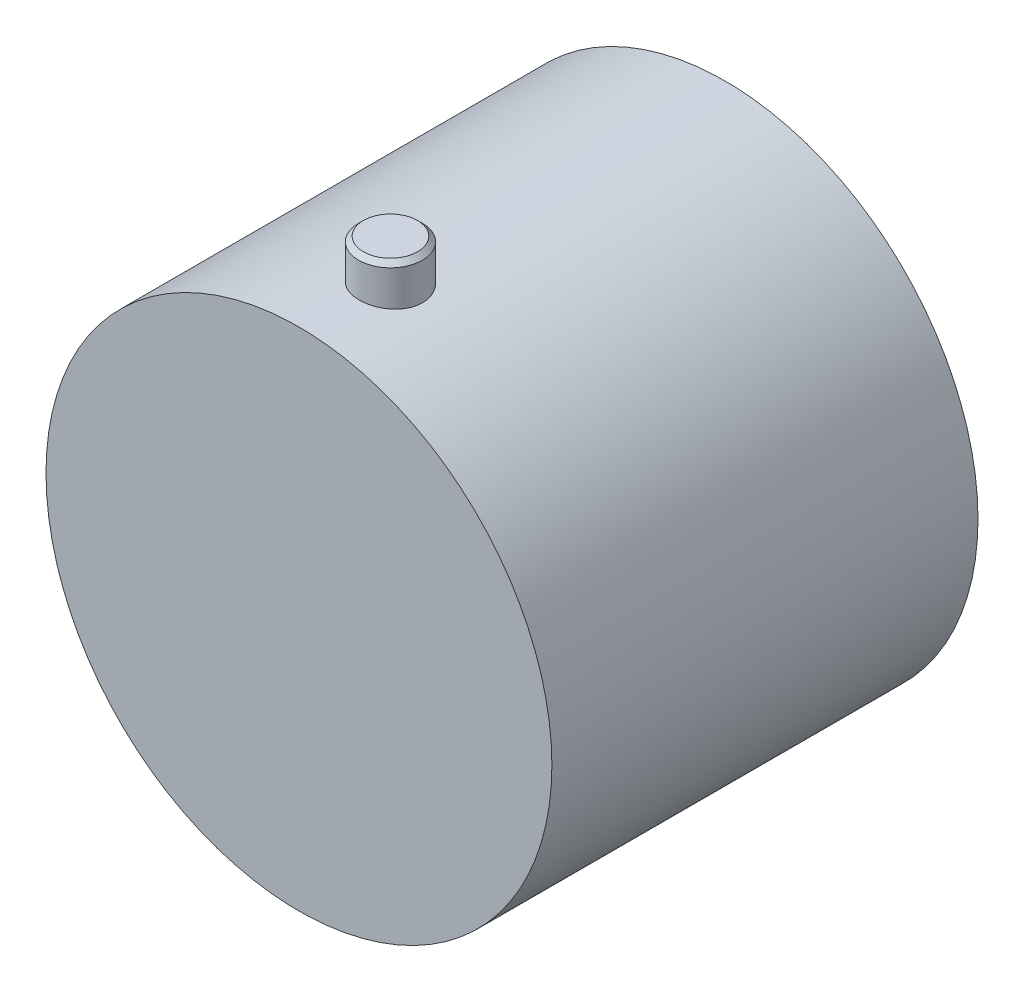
from build123d import *

# Parameters (mm, degrees)
SKETCH1_R      = 26
EXTRUDE1_DEPTH = 43.8
SKETCH2_R      = 3.285774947
EXTRUDE2_DEPTH = 30
CHAMFER1_SIZE  = 0.5


with BuildPart() as part:
    # Sketch1 → Extrude1 (new body)
    with BuildSketch(Plane.XY):
        Circle(SKETCH1_R)
    extrude(amount=EXTRUDE1_DEPTH)

    # Sketch2 → Extrude2 (add)
    with BuildSketch(Plane(origin=(0, 0, 0), x_dir=(1, 0, 0), z_dir=(0, 1, 0))):
        with Locations(Location((0.619957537, -35.012101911, 0), (0, 0, 90))):
            Circle(SKETCH2_R)
    extrude(amount=EXTRUDE2_DEPTH)

    # Chamfer1
    chamfer1_edges = [part.edges().sort_by_distance(p)[0] for p in [
        (0.619957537, 30, 38.297876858),
    ]]
    chamfer(chamfer1_edges, length=CHAMFER1_SIZE)


solid = part.part
